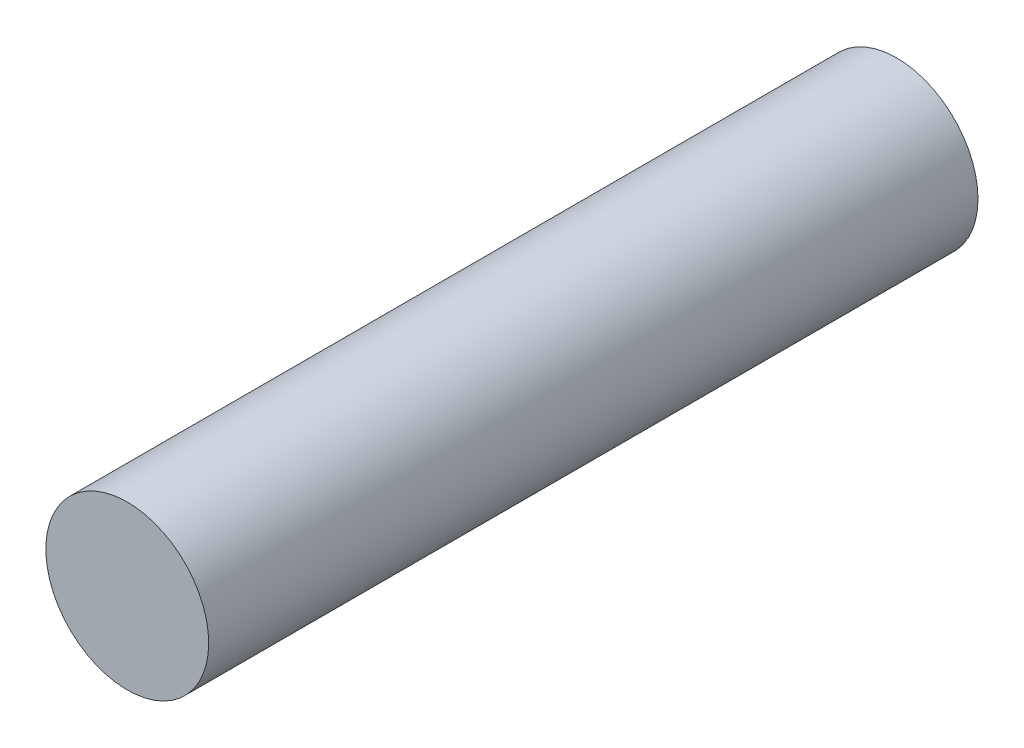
from build123d import *

# Parameters (mm, degrees)
SKETCH_1_R      = 3.175
EXTRUDE_1_DEPTH = 30


with BuildPart() as part:
    # Sketch 1 → Extrude 1 (new body)
    with BuildSketch(Plane.XY):
        Circle(SKETCH_1_R)
    extrude(amount=EXTRUDE_1_DEPTH)


solid = part.part
